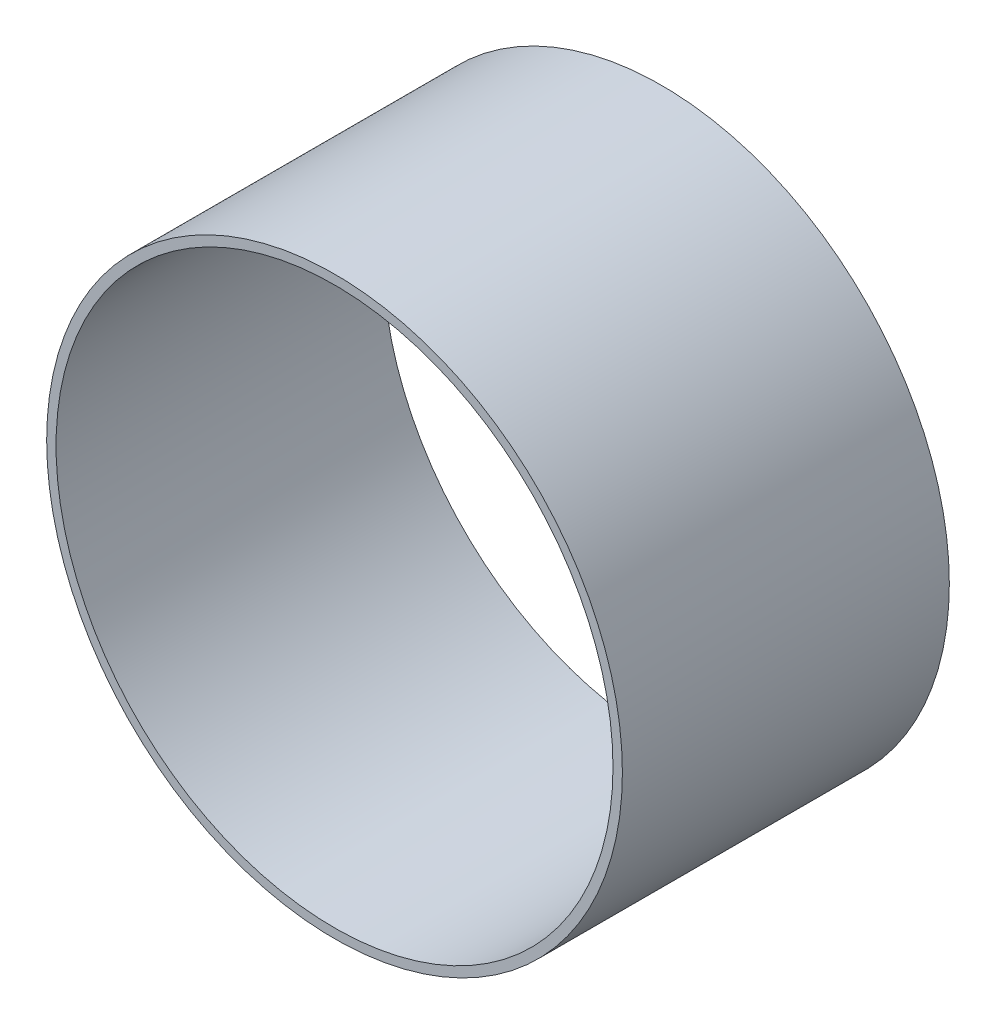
from build123d import *

# Parameters (mm, degrees)
SKETCH1_R           = 23.33244
SKETCH1_R_2         = 22.57044
EXTRUDE_THIN1_DEPTH = 13.25


with BuildPart() as part:
    # Sketch1 → Extrude-Thin1 (new, symmetric)
    with BuildSketch(Plane.XY):
        Circle(SKETCH1_R)
        Circle(SKETCH1_R_2, mode=Mode.SUBTRACT)
    extrude(amount=EXTRUDE_THIN1_DEPTH, both=True)


solid = part.part
